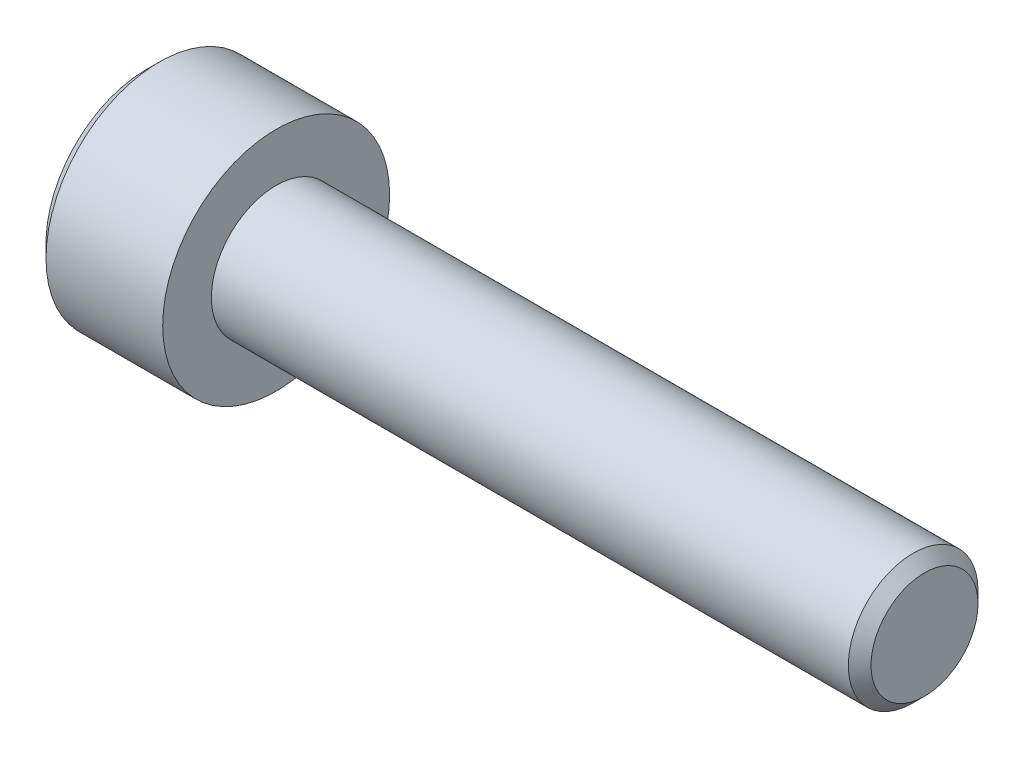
ISO-10303-21;
HEADER;
FILE_DESCRIPTION(('STEP AP214'),'2;1');
FILE_NAME('part.step','',(''),(''),'','','');
FILE_SCHEMA(('AUTOMOTIVE_DESIGN { 1 0 10303 214 1 1 1 1 }'));
ENDSEC;
DATA;
#1=APPLICATION_CONTEXT('core data for automotive mechanical design processes');
#2=APPLICATION_PROTOCOL_DEFINITION('international standard','automotive_design',2000,#1);
#3=PRODUCT_CONTEXT('',#1,'mechanical');
#4=PRODUCT('Part','Part','',(#3));
#5=PRODUCT_RELATED_PRODUCT_CATEGORY('part','',(#4));
#6=PRODUCT_DEFINITION_FORMATION('','',#4);
#7=PRODUCT_DEFINITION_CONTEXT('part definition',#1,'design');
#8=PRODUCT_DEFINITION('design','',#6,#7);
#9=PRODUCT_DEFINITION_SHAPE('','',#8);
#10=(LENGTH_UNIT() NAMED_UNIT(*) SI_UNIT(.MILLI.,.METRE.));
#11=(NAMED_UNIT(*) PLANE_ANGLE_UNIT() SI_UNIT($,.RADIAN.));
#12=(NAMED_UNIT(*) SI_UNIT($,.STERADIAN.) SOLID_ANGLE_UNIT());
#13=UNCERTAINTY_MEASURE_WITH_UNIT(LENGTH_MEASURE(1.E-05),#10,'distance_accuracy_value','');
#14=(GEOMETRIC_REPRESENTATION_CONTEXT(3) GLOBAL_UNCERTAINTY_ASSIGNED_CONTEXT((#13)) GLOBAL_UNIT_ASSIGNED_CONTEXT((#10,
#11,#12)) REPRESENTATION_CONTEXT('',''));
#15=CARTESIAN_POINT('',(0.,0.,0.));
#16=DIRECTION('',(0.,0.,1.));
#17=DIRECTION('',(1.,0.,0.));
#18=AXIS2_PLACEMENT_3D('',#15,#16,#17);
#19=CARTESIAN_POINT('',(4.,0.,0.));
#20=DIRECTION('',(-1.,0.,0.));
#21=DIRECTION('',(0.,0.,1.));
#22=AXIS2_PLACEMENT_3D('',#19,#20,#21);
#23=CYLINDRICAL_SURFACE('',#22,3.5);
#24=CARTESIAN_POINT('',(0.400000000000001,0.,0.));
#25=DIRECTION('',(1.,0.,0.));
#26=DIRECTION('',(0.,0.,-1.));
#27=AXIS2_PLACEMENT_3D('',#24,#25,#26);
#28=CIRCLE('',#27,3.5);
#29=CARTESIAN_POINT('',(0.400000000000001,0.,-3.5));
#30=VERTEX_POINT('',#29);
#31=EDGE_CURVE('E154',#30,#30,#28,.T.);
#32=ORIENTED_EDGE('',*,*,#31,.T.);
#33=EDGE_LOOP('',(#32));
#34=FACE_BOUND('',#33,.T.);
#35=CARTESIAN_POINT('',(4.,0.,0.));
#36=DIRECTION('',(1.,0.,0.));
#37=DIRECTION('',(0.,0.,-1.));
#38=AXIS2_PLACEMENT_3D('',#35,#36,#37);
#39=CIRCLE('',#38,3.5);
#40=CARTESIAN_POINT('',(4.,0.,-3.5));
#41=VERTEX_POINT('',#40);
#42=EDGE_CURVE('E146',#41,#41,#39,.T.);
#43=ORIENTED_EDGE('',*,*,#42,.F.);
#44=EDGE_LOOP('',(#43));
#45=FACE_BOUND('',#44,.T.);
#46=ADVANCED_FACE('F43',(#34,#45),#23,.T.);
#47=CARTESIAN_POINT('',(4.,0.,0.));
#48=DIRECTION('',(1.,0.,0.));
#49=DIRECTION('',(0.,0.,-1.));
#50=AXIS2_PLACEMENT_3D('',#47,#48,#49);
#51=PLANE('',#50);
#52=CARTESIAN_POINT('',(4.,0.,0.));
#53=DIRECTION('',(1.,0.,0.));
#54=DIRECTION('',(0.,0.,-1.));
#55=AXIS2_PLACEMENT_3D('',#52,#53,#54);
#56=CIRCLE('',#55,2.);
#57=CARTESIAN_POINT('',(4.,0.,-2.));
#58=VERTEX_POINT('',#57);
#59=EDGE_CURVE('E133',#58,#58,#56,.T.);
#60=ORIENTED_EDGE('',*,*,#59,.F.);
#61=EDGE_LOOP('',(#60));
#62=FACE_BOUND('',#61,.T.);
#63=ORIENTED_EDGE('',*,*,#42,.T.);
#64=EDGE_LOOP('',(#63));
#65=FACE_BOUND('',#64,.T.);
#66=ADVANCED_FACE('F173',(#62,#65),#51,.T.);
#67=CARTESIAN_POINT('',(0.,0.,0.));
#68=DIRECTION('',(1.,0.,0.));
#69=DIRECTION('',(0.,0.,-1.));
#70=AXIS2_PLACEMENT_3D('',#67,#68,#69);
#71=PLANE('',#70);
#72=CARTESIAN_POINT('',(0.,0.,0.));
#73=DIRECTION('',(1.,0.,0.));
#74=DIRECTION('',(0.,0.,-1.));
#75=AXIS2_PLACEMENT_3D('',#72,#73,#74);
#76=CIRCLE('',#75,3.1);
#77=CARTESIAN_POINT('',(0.,0.,-3.1));
#78=VERTEX_POINT('',#77);
#79=EDGE_CURVE('E157',#78,#78,#76,.F.);
#80=ORIENTED_EDGE('',*,*,#79,.T.);
#81=EDGE_LOOP('',(#80));
#82=FACE_BOUND('',#81,.T.);
#83=DIRECTION('',(0.,-0.866025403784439,0.5));
#84=VECTOR('',#83,1.);
#85=CARTESIAN_POINT('',(0.,0.,-1.73205080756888));
#86=LINE('',#85,#84);
#87=CARTESIAN_POINT('',(0.,0.,-1.73205080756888));
#88=VERTEX_POINT('',#87);
#89=CARTESIAN_POINT('',(0.,-1.5,-0.866025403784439));
#90=VERTEX_POINT('',#89);
#91=EDGE_CURVE('E132',#88,#90,#86,.T.);
#92=ORIENTED_EDGE('',*,*,#91,.F.);
#93=DIRECTION('',(0.,-0.866025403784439,-0.5));
#94=VECTOR('',#93,1.);
#95=CARTESIAN_POINT('',(0.,1.5,-0.866025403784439));
#96=LINE('',#95,#94);
#97=CARTESIAN_POINT('',(0.,1.5,-0.866025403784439));
#98=VERTEX_POINT('',#97);
#99=EDGE_CURVE('E58',#98,#88,#96,.T.);
#100=ORIENTED_EDGE('',*,*,#99,.F.);
#101=DIRECTION('',(0.,0.,-1.));
#102=VECTOR('',#101,1.);
#103=CARTESIAN_POINT('',(0.,1.5,0.866025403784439));
#104=LINE('',#103,#102);
#105=CARTESIAN_POINT('',(0.,1.5,0.866025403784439));
#106=VERTEX_POINT('',#105);
#107=EDGE_CURVE('E142',#106,#98,#104,.T.);
#108=ORIENTED_EDGE('',*,*,#107,.F.);
#109=DIRECTION('',(0.,0.866025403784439,-0.5));
#110=VECTOR('',#109,1.);
#111=CARTESIAN_POINT('',(0.,0.,1.73205080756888));
#112=LINE('',#111,#110);
#113=CARTESIAN_POINT('',(0.,0.,1.73205080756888));
#114=VERTEX_POINT('',#113);
#115=EDGE_CURVE('E140',#114,#106,#112,.T.);
#116=ORIENTED_EDGE('',*,*,#115,.F.);
#117=DIRECTION('',(0.,0.866025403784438,0.5));
#118=VECTOR('',#117,1.);
#119=CARTESIAN_POINT('',(0.,-1.5,0.866025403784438));
#120=LINE('',#119,#118);
#121=CARTESIAN_POINT('',(0.,-1.5,0.866025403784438));
#122=VERTEX_POINT('',#121);
#123=EDGE_CURVE('E106',#122,#114,#120,.T.);
#124=ORIENTED_EDGE('',*,*,#123,.F.);
#125=DIRECTION('',(0.,0.,1.));
#126=VECTOR('',#125,1.);
#127=CARTESIAN_POINT('',(0.,-1.5,-0.866025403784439));
#128=LINE('',#127,#126);
#129=EDGE_CURVE('E136',#90,#122,#128,.T.);
#130=ORIENTED_EDGE('',*,*,#129,.F.);
#131=EDGE_LOOP('',(#92,#100,#108,#116,#124,#130));
#132=FACE_BOUND('',#131,.T.);
#133=ADVANCED_FACE('F181',(#82,#132),#71,.F.);
#134=CARTESIAN_POINT('',(2.2,1.5,-0.866025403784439));
#135=DIRECTION('',(0.,0.5,-0.866025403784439));
#136=DIRECTION('',(0.,0.866025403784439,0.5));
#137=AXIS2_PLACEMENT_3D('',#134,#135,#136);
#138=PLANE('',#137);
#139=ORIENTED_EDGE('',*,*,#99,.T.);
#140=DIRECTION('',(-1.,0.,0.));
#141=VECTOR('',#140,1.);
#142=CARTESIAN_POINT('',(2.2,0.,-1.73205080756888));
#143=LINE('',#142,#141);
#144=CARTESIAN_POINT('',(2.2,0.,-1.73205080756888));
#145=VERTEX_POINT('',#144);
#146=EDGE_CURVE('E88',#145,#88,#143,.T.);
#147=ORIENTED_EDGE('',*,*,#146,.F.);
#148=DIRECTION('',(0.,-0.866025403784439,-0.5));
#149=VECTOR('',#148,1.);
#150=CARTESIAN_POINT('',(2.2,1.5,-0.866025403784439));
#151=LINE('',#150,#149);
#152=CARTESIAN_POINT('',(2.2,1.5,-0.866025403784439));
#153=VERTEX_POINT('',#152);
#154=EDGE_CURVE('E144',#153,#145,#151,.T.);
#155=ORIENTED_EDGE('',*,*,#154,.F.);
#156=DIRECTION('',(-1.,0.,0.));
#157=VECTOR('',#156,1.);
#158=CARTESIAN_POINT('',(2.2,1.5,-0.866025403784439));
#159=LINE('',#158,#157);
#160=EDGE_CURVE('E66',#153,#98,#159,.T.);
#161=ORIENTED_EDGE('',*,*,#160,.T.);
#162=EDGE_LOOP('',(#139,#147,#155,#161));
#163=FACE_BOUND('',#162,.T.);
#164=ADVANCED_FACE('F201',(#163),#138,.F.);
#165=CARTESIAN_POINT('',(2.2,1.5,0.866025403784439));
#166=DIRECTION('',(0.,1.,0.));
#167=DIRECTION('',(0.,0.,1.));
#168=AXIS2_PLACEMENT_3D('',#165,#166,#167);
#169=PLANE('',#168);
#170=ORIENTED_EDGE('',*,*,#107,.T.);
#171=ORIENTED_EDGE('',*,*,#160,.F.);
#172=DIRECTION('',(0.,0.,-1.));
#173=VECTOR('',#172,1.);
#174=CARTESIAN_POINT('',(2.2,1.5,0.866025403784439));
#175=LINE('',#174,#173);
#176=CARTESIAN_POINT('',(2.2,1.5,0.866025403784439));
#177=VERTEX_POINT('',#176);
#178=EDGE_CURVE('E118',#177,#153,#175,.T.);
#179=ORIENTED_EDGE('',*,*,#178,.F.);
#180=DIRECTION('',(-1.,0.,0.));
#181=VECTOR('',#180,1.);
#182=CARTESIAN_POINT('',(2.2,1.5,0.866025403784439));
#183=LINE('',#182,#181);
#184=EDGE_CURVE('E110',#177,#106,#183,.T.);
#185=ORIENTED_EDGE('',*,*,#184,.T.);
#186=EDGE_LOOP('',(#170,#171,#179,#185));
#187=FACE_BOUND('',#186,.T.);
#188=ADVANCED_FACE('F214',(#187),#169,.F.);
#189=CARTESIAN_POINT('',(2.2,0.,1.73205080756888));
#190=DIRECTION('',(0.,0.5,0.866025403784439));
#191=DIRECTION('',(0.,-0.866025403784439,0.5));
#192=AXIS2_PLACEMENT_3D('',#189,#190,#191);
#193=PLANE('',#192);
#194=ORIENTED_EDGE('',*,*,#115,.T.);
#195=ORIENTED_EDGE('',*,*,#184,.F.);
#196=DIRECTION('',(0.,0.866025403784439,-0.5));
#197=VECTOR('',#196,1.);
#198=CARTESIAN_POINT('',(2.2,0.,1.73205080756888));
#199=LINE('',#198,#197);
#200=CARTESIAN_POINT('',(2.2,0.,1.73205080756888));
#201=VERTEX_POINT('',#200);
#202=EDGE_CURVE('E114',#201,#177,#199,.T.);
#203=ORIENTED_EDGE('',*,*,#202,.F.);
#204=DIRECTION('',(-1.,0.,0.));
#205=VECTOR('',#204,1.);
#206=CARTESIAN_POINT('',(2.2,0.,1.73205080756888));
#207=LINE('',#206,#205);
#208=EDGE_CURVE('E99',#201,#114,#207,.T.);
#209=ORIENTED_EDGE('',*,*,#208,.T.);
#210=EDGE_LOOP('',(#194,#195,#203,#209));
#211=FACE_BOUND('',#210,.T.);
#212=ADVANCED_FACE('F115',(#211),#193,.F.);
#213=CARTESIAN_POINT('',(2.2,-1.5,0.866025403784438));
#214=DIRECTION('',(0.,-0.5,0.866025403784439));
#215=DIRECTION('',(0.,-0.866025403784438,-0.5));
#216=AXIS2_PLACEMENT_3D('',#213,#214,#215);
#217=PLANE('',#216);
#218=ORIENTED_EDGE('',*,*,#123,.T.);
#219=ORIENTED_EDGE('',*,*,#208,.F.);
#220=DIRECTION('',(0.,0.866025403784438,0.5));
#221=VECTOR('',#220,1.);
#222=CARTESIAN_POINT('',(2.2,-1.5,0.866025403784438));
#223=LINE('',#222,#221);
#224=CARTESIAN_POINT('',(2.2,-1.5,0.866025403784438));
#225=VERTEX_POINT('',#224);
#226=EDGE_CURVE('E103',#225,#201,#223,.T.);
#227=ORIENTED_EDGE('',*,*,#226,.F.);
#228=DIRECTION('',(-1.,0.,0.));
#229=VECTOR('',#228,1.);
#230=CARTESIAN_POINT('',(2.2,-1.5,0.866025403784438));
#231=LINE('',#230,#229);
#232=EDGE_CURVE('E111',#225,#122,#231,.T.);
#233=ORIENTED_EDGE('',*,*,#232,.T.);
#234=EDGE_LOOP('',(#218,#219,#227,#233));
#235=FACE_BOUND('',#234,.T.);
#236=ADVANCED_FACE('F101',(#235),#217,.F.);
#237=CARTESIAN_POINT('',(2.2,-1.5,-0.866025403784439));
#238=DIRECTION('',(0.,-1.,0.));
#239=DIRECTION('',(0.,0.,-1.));
#240=AXIS2_PLACEMENT_3D('',#237,#238,#239);
#241=PLANE('',#240);
#242=ORIENTED_EDGE('',*,*,#129,.T.);
#243=ORIENTED_EDGE('',*,*,#232,.F.);
#244=DIRECTION('',(0.,0.,1.));
#245=VECTOR('',#244,1.);
#246=CARTESIAN_POINT('',(2.2,-1.5,-0.866025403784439));
#247=LINE('',#246,#245);
#248=CARTESIAN_POINT('',(2.2,-1.5,-0.866025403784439));
#249=VERTEX_POINT('',#248);
#250=EDGE_CURVE('E124',#249,#225,#247,.T.);
#251=ORIENTED_EDGE('',*,*,#250,.F.);
#252=DIRECTION('',(-1.,0.,0.));
#253=VECTOR('',#252,1.);
#254=CARTESIAN_POINT('',(2.2,-1.5,-0.866025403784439));
#255=LINE('',#254,#253);
#256=EDGE_CURVE('E149',#249,#90,#255,.T.);
#257=ORIENTED_EDGE('',*,*,#256,.T.);
#258=EDGE_LOOP('',(#242,#243,#251,#257));
#259=FACE_BOUND('',#258,.T.);
#260=ADVANCED_FACE('F223',(#259),#241,.F.);
#261=CARTESIAN_POINT('',(2.2,0.,-1.73205080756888));
#262=DIRECTION('',(0.,-0.5,-0.866025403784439));
#263=DIRECTION('',(0.,0.866025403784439,-0.5));
#264=AXIS2_PLACEMENT_3D('',#261,#262,#263);
#265=PLANE('',#264);
#266=ORIENTED_EDGE('',*,*,#91,.T.);
#267=ORIENTED_EDGE('',*,*,#256,.F.);
#268=DIRECTION('',(0.,-0.866025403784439,0.5));
#269=VECTOR('',#268,1.);
#270=CARTESIAN_POINT('',(2.2,0.,-1.73205080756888));
#271=LINE('',#270,#269);
#272=EDGE_CURVE('E126',#145,#249,#271,.T.);
#273=ORIENTED_EDGE('',*,*,#272,.F.);
#274=ORIENTED_EDGE('',*,*,#146,.T.);
#275=EDGE_LOOP('',(#266,#267,#273,#274));
#276=FACE_BOUND('',#275,.T.);
#277=ADVANCED_FACE('F194',(#276),#265,.F.);
#278=CARTESIAN_POINT('',(2.2,0.,0.));
#279=DIRECTION('',(-1.,0.,0.));
#280=DIRECTION('',(0.,0.,1.));
#281=AXIS2_PLACEMENT_3D('',#278,#279,#280);
#282=PLANE('',#281);
#283=ORIENTED_EDGE('',*,*,#154,.T.);
#284=ORIENTED_EDGE('',*,*,#272,.T.);
#285=ORIENTED_EDGE('',*,*,#250,.T.);
#286=ORIENTED_EDGE('',*,*,#226,.T.);
#287=ORIENTED_EDGE('',*,*,#202,.T.);
#288=ORIENTED_EDGE('',*,*,#178,.T.);
#289=EDGE_LOOP('',(#283,#284,#285,#286,#287,#288));
#290=FACE_BOUND('',#289,.T.);
#291=ADVANCED_FACE('F121',(#290),#282,.T.);
#292=CARTESIAN_POINT('',(0.400000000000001,0.,0.));
#293=DIRECTION('',(1.,0.,0.));
#294=DIRECTION('',(0.,0.,-1.));
#295=AXIS2_PLACEMENT_3D('',#292,#293,#294);
#296=CONICAL_SURFACE('',#295,3.5,0.78539816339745);
#297=ORIENTED_EDGE('',*,*,#79,.F.);
#298=EDGE_LOOP('',(#297));
#299=FACE_BOUND('',#298,.T.);
#300=ORIENTED_EDGE('',*,*,#31,.F.);
#301=EDGE_LOOP('',(#300));
#302=FACE_BOUND('',#301,.T.);
#303=ADVANCED_FACE('F186',(#299,#302),#296,.T.);
#304=CARTESIAN_POINT('',(24.,0.,0.));
#305=DIRECTION('',(-1.,0.,0.));
#306=DIRECTION('',(0.,0.,1.));
#307=AXIS2_PLACEMENT_3D('',#304,#305,#306);
#308=CYLINDRICAL_SURFACE('',#307,2.);
#309=CARTESIAN_POINT('',(23.65,0.,0.));
#310=DIRECTION('',(1.,0.,0.));
#311=DIRECTION('',(0.,0.,-1.));
#312=AXIS2_PLACEMENT_3D('',#309,#310,#311);
#313=CIRCLE('',#312,2.);
#314=CARTESIAN_POINT('',(23.65,0.,-2.));
#315=VERTEX_POINT('',#314);
#316=EDGE_CURVE('E11',#315,#315,#313,.F.);
#317=ORIENTED_EDGE('',*,*,#316,.T.);
#318=EDGE_LOOP('',(#317));
#319=FACE_BOUND('',#318,.T.);
#320=ORIENTED_EDGE('',*,*,#59,.T.);
#321=EDGE_LOOP('',(#320));
#322=FACE_BOUND('',#321,.T.);
#323=ADVANCED_FACE('F169',(#319,#322),#308,.T.);
#324=CARTESIAN_POINT('',(24.,0.,0.));
#325=DIRECTION('',(1.,0.,0.));
#326=DIRECTION('',(0.,0.,-1.));
#327=AXIS2_PLACEMENT_3D('',#324,#325,#326);
#328=PLANE('',#327);
#329=CARTESIAN_POINT('',(24.,0.,0.));
#330=DIRECTION('',(1.,0.,0.));
#331=DIRECTION('',(0.,0.,-1.));
#332=AXIS2_PLACEMENT_3D('',#329,#330,#331);
#333=CIRCLE('',#332,1.65);
#334=CARTESIAN_POINT('',(24.,0.,-1.65));
#335=VERTEX_POINT('',#334);
#336=EDGE_CURVE('E51',#335,#335,#333,.T.);
#337=ORIENTED_EDGE('',*,*,#336,.T.);
#338=EDGE_LOOP('',(#337));
#339=FACE_BOUND('',#338,.T.);
#340=ADVANCED_FACE('F162',(#339),#328,.T.);
#341=CARTESIAN_POINT('',(24.,0.,0.));
#342=DIRECTION('',(-1.,0.,0.));
#343=DIRECTION('',(0.,0.,1.));
#344=AXIS2_PLACEMENT_3D('',#341,#342,#343);
#345=CONICAL_SURFACE('',#344,1.65,0.785398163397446);
#346=ORIENTED_EDGE('',*,*,#316,.F.);
#347=EDGE_LOOP('',(#346));
#348=FACE_BOUND('',#347,.T.);
#349=ORIENTED_EDGE('',*,*,#336,.F.);
#350=EDGE_LOOP('',(#349));
#351=FACE_BOUND('',#350,.T.);
#352=ADVANCED_FACE('F45',(#348,#351),#345,.T.);
#353=CLOSED_SHELL('',(#46,#66,#133,#164,#188,#212,#236,#260,#277,#291,#303,#323,#340,#352));
#354=MANIFOLD_SOLID_BREP('B2',#353);
#355=ADVANCED_BREP_SHAPE_REPRESENTATION('',(#18,#354),#14);
#356=SHAPE_DEFINITION_REPRESENTATION(#9,#355);
ENDSEC;
END-ISO-10303-21;
